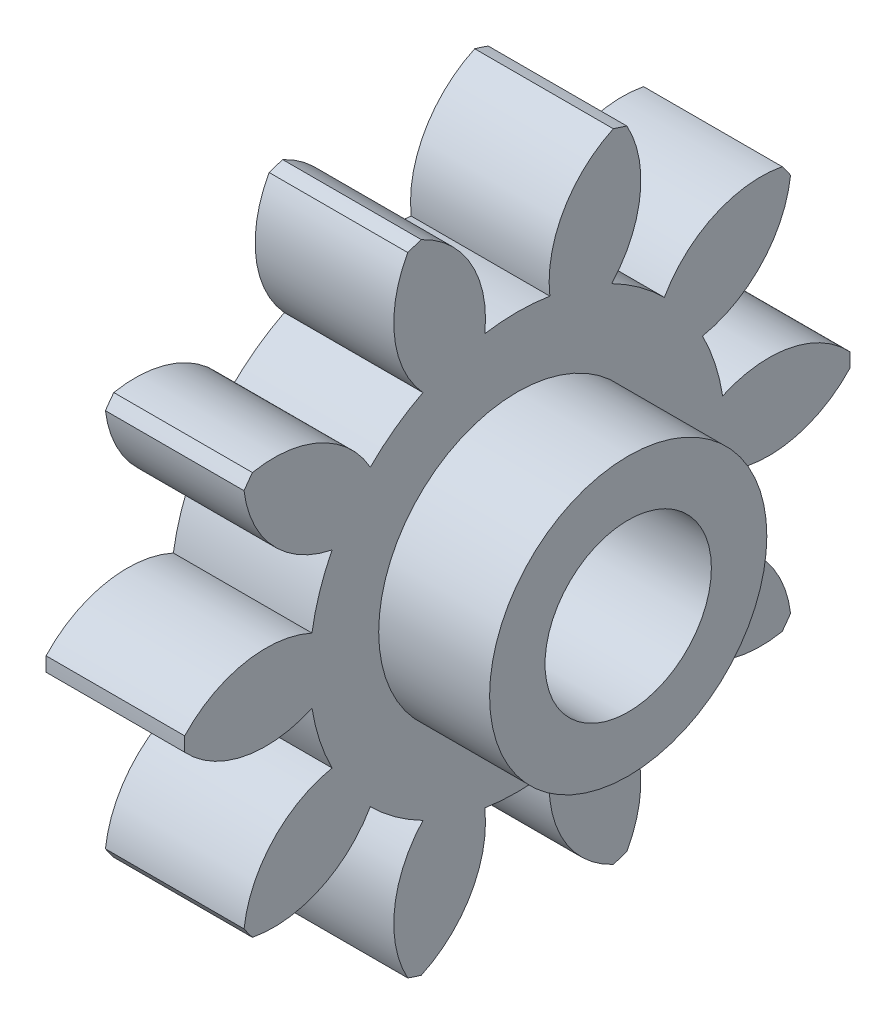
from build123d import *

# Parameters (mm, degrees)
BASPROSKE_W         = 5
BASPROSKE_H         = 12
TOOTHCUT_DEPTH      = 18.691806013
TEETHCUTS_COUNT     = 10
TEETHCUTS_ANGLE     = 324
BORSKE_R            = 3
BORE_DEPTH          = 50.0000508
BOSS_EXTRUDE1_START = 4
SKETCH1_R           = 5
SKETCH1_R_2         = 3
BOSS_EXTRUDE1_DEPTH = 4


with BuildPart() as part:
    # BasProSke → Base-Revolve (revolve)
    with BuildSketch(Plane(origin=(0, 0, 0), x_dir=(1, 0, 0), z_dir=(0, 1, 0)), mode=Mode.PRIVATE) as base_revolve_sk:
        with Locations((2.5, 6)):
            Rectangle(BASPROSKE_W, BASPROSKE_H)
    revolve(base_revolve_sk.sketch.rotate(Axis((-10, 0, 0), (1, 0, 0)), 180), axis=Axis((-10, 0, 0), (1, 0, 0)))

    # TooCutSke → ToothCut (cut, through all)
    with BuildSketch(Plane(origin=(0, 0, 0), x_dir=(0, 0, -1), z_dir=(1, 0, 0))):
        with BuildLine():
            ThreePointArc((1.173662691, 7.406586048), (0, 7.499), (-1.173662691, 7.406586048))
            ThreePointArc((-1.173662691, 7.406586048), (-1.668191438, 9.834565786), (-3.497907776, 11.50542856))
            ThreePointArc((-3.497907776, 11.50542856), (0, 12.0254), (3.497907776, 11.50542856))
            ThreePointArc((3.497907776, 11.50542856), (1.668191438, 9.834565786), (1.173662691, 7.406586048))
        make_face()
    toothcut = extrude(amount=TOOTHCUT_DEPTH, mode=Mode.SUBTRACT)

    # TeethCuts: ToothCut ×10 about axis
    teethcuts_axis = Axis((-10, 0, 0), (1, 0, 0))
    for i in range(1, TEETHCUTS_COUNT):
        add(toothcut.rotate(teethcuts_axis, i * TEETHCUTS_ANGLE / (TEETHCUTS_COUNT - 1)), mode=Mode.SUBTRACT)

    # BorSke → Bore (cut, symmetric)
    with BuildSketch(Plane(origin=(0, 0, 0), x_dir=(0, 0, -1), z_dir=(1, 0, 0))):
        with Locations(Location((0, 0, 0), (0, 0, 180))):
            Circle(BORSKE_R)
    extrude(amount=BORE_DEPTH, both=True, mode=Mode.SUBTRACT)

    # Sketch1 → Boss-Extrude1 (add)
    with BuildSketch(Plane(origin=(5, 0, 0), x_dir=(0, 0, -1), z_dir=(1, 0, 0)).offset(BOSS_EXTRUDE1_START)):
        with Locations(Location((0, 0, 0), (0, 0, 180))):
            Circle(SKETCH1_R)
        Circle(SKETCH1_R_2, mode=Mode.SUBTRACT)
    extrude(amount=-BOSS_EXTRUDE1_DEPTH)


solid = part.part
